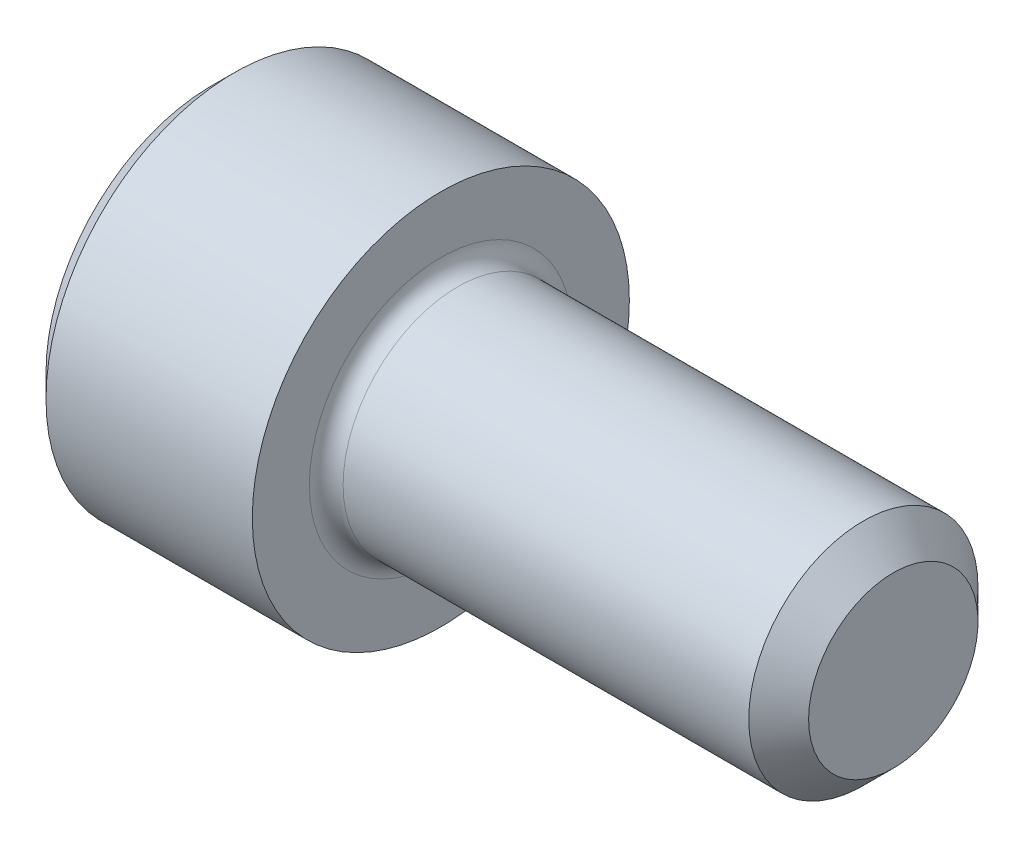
from build123d import *

# Parameters (mm, degrees)
FILLET1_R   = 0.3556
HEX_2_DEPTH = 2.286


with BuildPart() as part:
    # BodySke → Base-Revolve (revolve)
    with BuildSketch(Plane.XY, mode=Mode.PRIVATE) as base_revolve_sk:
        Polygon((0, 0), (0, 3.48615), (0.4826, 3.96875), (4.826, 3.96875), (4.826, 2.413), (13.72108, 2.413), (14.351, 1.78308), (14.351, 0), align=None)
    revolve(base_revolve_sk.sketch.rotate(Axis((-31.75, 0, 0), (1, 0, 0)), 90), axis=Axis((-31.75, 0, 0), (1, 0, 0)))

    # Fillet1
    fillet1_edges = [part.edges().sort_by_distance(p)[0] for p in [
        (4.826, 0, -2.413),
    ]]
    fillet(fillet1_edges, radius=FILLET1_R)

    # Sketch2 → Hex-PreBroach (revolve, cut)
    with BuildSketch(Plane.XY, mode=Mode.PRIVATE) as hex_prebroach_sk:
        Polygon((0, 1.98501), (2.286, 1.98501), (3.432046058, 0), (0, 0), align=None)
    revolve(hex_prebroach_sk.sketch.rotate(Axis((0, 0, 0), (1, 0, 0)), 270), axis=Axis((0, 0, 0), (1, 0, 0)), mode=Mode.SUBTRACT)

    # Sketch3 → Hex 2 (cut)
    with BuildSketch(Plane(origin=(0, 0, 0), x_dir=(0, 0.500000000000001, 0.866025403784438), z_dir=(-1, 0, 0))):
        Polygon((1.146046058, 1.98501), (-1.146046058, 1.98501), (-2.292092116, 0), (-1.146046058, -1.98501), (1.146046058, -1.98501), (2.292092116, 0), align=None)
    extrude(amount=-HEX_2_DEPTH, mode=Mode.SUBTRACT)


solid = part.part
